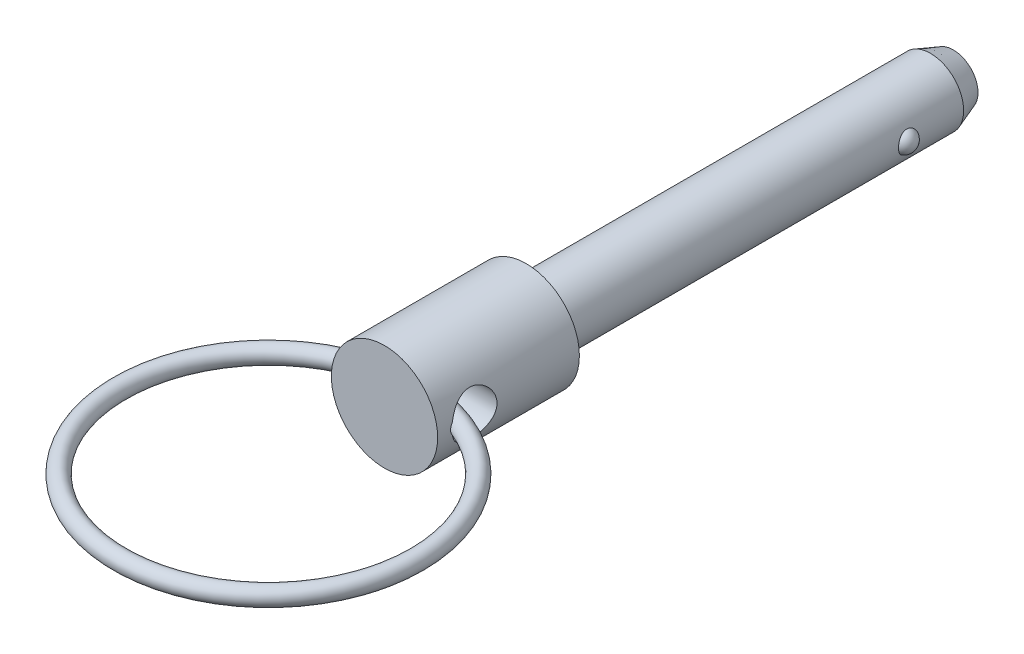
ISO-10303-21;
HEADER;
FILE_DESCRIPTION(('STEP AP214'),'2;1');
FILE_NAME('part.step','',(''),(''),'','','');
FILE_SCHEMA(('AUTOMOTIVE_DESIGN { 1 0 10303 214 1 1 1 1 }'));
ENDSEC;
DATA;
#1=APPLICATION_CONTEXT('core data for automotive mechanical design processes');
#2=APPLICATION_PROTOCOL_DEFINITION('international standard','automotive_design',2000,#1);
#3=PRODUCT_CONTEXT('',#1,'mechanical');
#4=PRODUCT('Part','Part','',(#3));
#5=PRODUCT_RELATED_PRODUCT_CATEGORY('part','',(#4));
#6=PRODUCT_DEFINITION_FORMATION('','',#4);
#7=PRODUCT_DEFINITION_CONTEXT('part definition',#1,'design');
#8=PRODUCT_DEFINITION('design','',#6,#7);
#9=PRODUCT_DEFINITION_SHAPE('','',#8);
#10=(LENGTH_UNIT() NAMED_UNIT(*) SI_UNIT(.MILLI.,.METRE.));
#11=(NAMED_UNIT(*) PLANE_ANGLE_UNIT() SI_UNIT($,.RADIAN.));
#12=(NAMED_UNIT(*) SI_UNIT($,.STERADIAN.) SOLID_ANGLE_UNIT());
#13=UNCERTAINTY_MEASURE_WITH_UNIT(LENGTH_MEASURE(1.E-05),#10,'distance_accuracy_value','');
#14=(GEOMETRIC_REPRESENTATION_CONTEXT(3) GLOBAL_UNCERTAINTY_ASSIGNED_CONTEXT((#13)) GLOBAL_UNIT_ASSIGNED_CONTEXT((#10,
#11,#12)) REPRESENTATION_CONTEXT('',''));
#15=CARTESIAN_POINT('',(0.,0.,0.));
#16=DIRECTION('',(0.,0.,1.));
#17=DIRECTION('',(1.,0.,0.));
#18=AXIS2_PLACEMENT_3D('',#15,#16,#17);
#19=CARTESIAN_POINT('',(6.35,0.,9.398));
#20=DIRECTION('',(-1.,0.,0.));
#21=DIRECTION('',(0.,0.,-1.));
#22=AXIS2_PLACEMENT_3D('',#19,#20,#21);
#23=CYLINDRICAL_SURFACE('',#22,2.0193);
#24=CARTESIAN_POINT('',(-4.76270000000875,0.498153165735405,11.3548893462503));
#25=CARTESIAN_POINT('',(-4.72833190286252,0.475048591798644,11.3607446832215));
#26=CARTESIAN_POINT('',(-4.69505034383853,0.449919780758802,11.3667299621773));
#27=CARTESIAN_POINT('',(-4.63192457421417,0.394832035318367,11.3785339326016));
#28=CARTESIAN_POINT('',(-4.60213511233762,0.364810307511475,11.3843491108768));
#29=CARTESIAN_POINT('',(-4.55535458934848,0.308281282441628,11.393775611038));
#30=CARTESIAN_POINT('',(-4.53705372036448,0.282907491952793,11.3975656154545));
#31=CARTESIAN_POINT('',(-4.50470768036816,0.229597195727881,11.4043835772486));
#32=CARTESIAN_POINT('',(-4.49064226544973,0.201673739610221,11.4074151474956));
#33=CARTESIAN_POINT('',(-4.46975490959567,0.148629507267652,11.4119668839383));
#34=CARTESIAN_POINT('',(-4.46210314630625,0.123852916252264,11.413657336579));
#35=CARTESIAN_POINT('',(-4.45097170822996,0.0733134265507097,11.4161269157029));
#36=CARTESIAN_POINT('',(-4.44749221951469,0.0475504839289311,11.4169060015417));
#37=CARTESIAN_POINT('',(-4.44500621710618,-0.00425946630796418,11.4174619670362));
#38=CARTESIAN_POINT('',(-4.44600914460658,-0.0303069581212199,11.4172367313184));
#39=CARTESIAN_POINT('',(-4.45241947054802,-0.0818207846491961,11.4158064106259));
#40=CARTESIAN_POINT('',(-4.45782777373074,-0.107286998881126,11.414601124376));
#41=CARTESIAN_POINT('',(-4.47240849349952,-0.156294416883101,11.4113883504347));
#42=CARTESIAN_POINT('',(-4.48147591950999,-0.179868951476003,11.4094032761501));
#43=CARTESIAN_POINT('',(-4.50279050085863,-0.225454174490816,11.404805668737));
#44=CARTESIAN_POINT('',(-4.51503925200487,-0.247464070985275,11.4021928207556));
#45=CARTESIAN_POINT('',(-4.55011891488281,-0.302206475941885,11.394845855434));
#46=CARTESIAN_POINT('',(-4.57493397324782,-0.333621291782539,11.3897686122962));
#47=CARTESIAN_POINT('',(-4.62912866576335,-0.392111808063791,11.3790894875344));
#48=CARTESIAN_POINT('',(-4.65852008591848,-0.419175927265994,11.3734862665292));
#49=CARTESIAN_POINT('',(-4.71307862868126,-0.4633355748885,11.3635175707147));
#50=CARTESIAN_POINT('',(-4.73757440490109,-0.481267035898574,11.3591766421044));
#51=CARTESIAN_POINT('',(-4.76270000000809,-0.498153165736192,11.3548893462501));
#52=B_SPLINE_CURVE_WITH_KNOTS('',3,(#24,#25,#26,#27,#28,#29,#30,#31,#32,#33,#34,#35,#36,#37,#38,
#39,#40,#41,#42,#43,#44,#45,#46,#47,#48,#49,#50,#51),.UNSPECIFIED.,.F.,.F.,(4,2,2,2,2,2,2,2,2,2,
2,2,2,4),(0.,0.125801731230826,0.253367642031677,0.347579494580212,0.441333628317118,
0.518959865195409,0.596589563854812,0.674382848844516,0.752192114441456,0.827911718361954,
0.903669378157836,1.02403641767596,1.14471874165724,1.23653238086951),.UNSPECIFIED.);
#53=CARTESIAN_POINT('',(-4.73813099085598,0.481166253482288,11.3591352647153));
#54=VERTEX_POINT('',#53);
#55=CARTESIAN_POINT('',(-4.73813099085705,-0.481166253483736,11.359135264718));
#56=VERTEX_POINT('',#55);
#57=EDGE_CURVE('E40',#54,#56,#52,.T.);
#58=ORIENTED_EDGE('',*,*,#57,.F.);
#59=CARTESIAN_POINT('',(-4.7625,0.,11.4173));
#60=CARTESIAN_POINT('',(-4.76249489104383,-0.108112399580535,11.4172937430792));
#61=CARTESIAN_POINT('',(-4.75878025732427,-0.216312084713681,11.408574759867));
#62=CARTESIAN_POINT('',(-4.74429807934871,-0.429541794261,11.3740482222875));
#63=CARTESIAN_POINT('',(-4.73352107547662,-0.534567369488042,11.3482177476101));
#64=CARTESIAN_POINT('',(-4.70606638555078,-0.738151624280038,11.2805979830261));
#65=CARTESIAN_POINT('',(-4.68940628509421,-0.836728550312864,11.2388562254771));
#66=CARTESIAN_POINT('',(-4.65179514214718,-1.02541561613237,11.1408163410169));
#67=CARTESIAN_POINT('',(-4.63084399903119,-1.11552555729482,11.0845178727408));
#68=CARTESIAN_POINT('',(-4.58553515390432,-1.28946876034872,10.9559107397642));
#69=CARTESIAN_POINT('',(-4.56106355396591,-1.37280723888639,10.8829734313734));
#70=CARTESIAN_POINT('',(-4.51195602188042,-1.52649281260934,10.7244940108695));
#71=CARTESIAN_POINT('',(-4.48732001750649,-1.5968337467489,10.6389459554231));
#72=CARTESIAN_POINT('',(-4.43925108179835,-1.72611165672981,10.4523438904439));
#73=CARTESIAN_POINT('',(-4.41594507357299,-1.78427664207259,10.3507188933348));
#74=CARTESIAN_POINT('',(-4.3749946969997,-1.88246618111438,10.1379969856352));
#75=CARTESIAN_POINT('',(-4.35734737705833,-1.92250019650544,10.0269050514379));
#76=CARTESIAN_POINT('',(-4.33095312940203,-1.98122376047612,9.80411364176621));
#77=CARTESIAN_POINT('',(-4.32180970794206,-2.00086973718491,9.692715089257));
#78=CARTESIAN_POINT('',(-4.31232297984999,-2.02124136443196,9.46785625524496));
#79=CARTESIAN_POINT('',(-4.31197457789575,-2.02197796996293,9.35439720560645));
#80=CARTESIAN_POINT('',(-4.31978298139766,-2.00522830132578,9.13832342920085));
#81=CARTESIAN_POINT('',(-4.32726229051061,-1.98919366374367,9.03556669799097));
#82=CARTESIAN_POINT('',(-4.34873498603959,-1.94179810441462,8.83436976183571));
#83=CARTESIAN_POINT('',(-4.36272967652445,-1.91043411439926,8.73593042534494));
#84=CARTESIAN_POINT('',(-4.39597564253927,-1.83265370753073,8.54363008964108));
#85=CARTESIAN_POINT('',(-4.41533413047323,-1.78592620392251,8.44991428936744));
#86=CARTESIAN_POINT('',(-4.45710273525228,-1.67896759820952,8.27128429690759));
#87=CARTESIAN_POINT('',(-4.47951396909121,-1.61873154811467,8.1863733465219));
#88=CARTESIAN_POINT('',(-4.52725353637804,-1.48026834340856,8.0199216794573));
#89=CARTESIAN_POINT('',(-4.55266534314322,-1.40092677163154,7.93932933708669));
#90=CARTESIAN_POINT('',(-4.6018976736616,-1.22958667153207,7.79224755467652));
#91=CARTESIAN_POINT('',(-4.62571737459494,-1.13758167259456,7.72576536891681));
#92=CARTESIAN_POINT('',(-4.66982369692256,-0.940529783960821,7.60732387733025));
#93=CARTESIAN_POINT('',(-4.69000583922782,-0.835212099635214,7.55577397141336));
#94=CARTESIAN_POINT('',(-4.72372878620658,-0.61641653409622,7.47153070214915));
#95=CARTESIAN_POINT('',(-4.73728278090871,-0.502955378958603,7.43879986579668));
#96=CARTESIAN_POINT('',(-4.75192155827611,-0.323662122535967,7.40374908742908));
#97=CARTESIAN_POINT('',(-4.75587275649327,-0.259363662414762,7.39437239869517));
#98=CARTESIAN_POINT('',(-4.76116348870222,-0.130053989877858,7.3818460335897));
#99=CARTESIAN_POINT('',(-4.76250307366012,-0.0650427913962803,7.37869623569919));
#100=CARTESIAN_POINT('',(-4.76249489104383,0.108112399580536,7.37870625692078));
#101=CARTESIAN_POINT('',(-4.75878025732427,0.21631208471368,7.38742524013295));
#102=CARTESIAN_POINT('',(-4.74429807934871,0.429541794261,7.42195177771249));
#103=CARTESIAN_POINT('',(-4.73352107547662,0.534567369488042,7.44778225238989));
#104=CARTESIAN_POINT('',(-4.70606638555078,0.738151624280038,7.51540201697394));
#105=CARTESIAN_POINT('',(-4.68940628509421,0.836728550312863,7.55714377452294));
#106=CARTESIAN_POINT('',(-4.65179514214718,1.02541561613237,7.65518365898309));
#107=CARTESIAN_POINT('',(-4.63084399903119,1.11552555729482,7.71148212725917));
#108=CARTESIAN_POINT('',(-4.58553515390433,1.28946876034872,7.84008926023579));
#109=CARTESIAN_POINT('',(-4.56106355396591,1.37280723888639,7.91302656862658));
#110=CARTESIAN_POINT('',(-4.51195602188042,1.52649281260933,8.07150598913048));
#111=CARTESIAN_POINT('',(-4.48732001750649,1.59683374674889,8.15705404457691));
#112=CARTESIAN_POINT('',(-4.43925108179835,1.7261116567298,8.34365610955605));
#113=CARTESIAN_POINT('',(-4.415945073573,1.78427664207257,8.44528110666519));
#114=CARTESIAN_POINT('',(-4.3749946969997,1.88246618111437,8.65800301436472));
#115=CARTESIAN_POINT('',(-4.35734737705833,1.92250019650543,8.76909494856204));
#116=CARTESIAN_POINT('',(-4.33095312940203,1.98122376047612,8.99188635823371));
#117=CARTESIAN_POINT('',(-4.32180970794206,2.0008697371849,9.10328491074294));
#118=CARTESIAN_POINT('',(-4.31232297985,2.02124136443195,9.32814374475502));
#119=CARTESIAN_POINT('',(-4.31197457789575,2.02197796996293,9.44160279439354));
#120=CARTESIAN_POINT('',(-4.31978298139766,2.00522830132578,9.65767657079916));
#121=CARTESIAN_POINT('',(-4.32726229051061,1.98919366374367,9.76043330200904));
#122=CARTESIAN_POINT('',(-4.34873498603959,1.94179810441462,9.96163023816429));
#123=CARTESIAN_POINT('',(-4.36272967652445,1.91043411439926,10.0600695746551));
#124=CARTESIAN_POINT('',(-4.39597564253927,1.83265370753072,10.2523699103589));
#125=CARTESIAN_POINT('',(-4.41533413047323,1.78592620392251,10.3460857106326));
#126=CARTESIAN_POINT('',(-4.45710273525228,1.67896759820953,10.5247157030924));
#127=CARTESIAN_POINT('',(-4.47951396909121,1.61873154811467,10.6096266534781));
#128=CARTESIAN_POINT('',(-4.52725353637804,1.48026834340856,10.7760783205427));
#129=CARTESIAN_POINT('',(-4.55266534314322,1.40092677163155,10.8566706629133));
#130=CARTESIAN_POINT('',(-4.6018976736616,1.22958667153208,11.0037524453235));
#131=CARTESIAN_POINT('',(-4.62571737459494,1.13758167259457,11.0702346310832));
#132=CARTESIAN_POINT('',(-4.66982369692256,0.940529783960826,11.1886761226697));
#133=CARTESIAN_POINT('',(-4.69000583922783,0.835212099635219,11.2402260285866));
#134=CARTESIAN_POINT('',(-4.72372878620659,0.616416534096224,11.3244692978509));
#135=CARTESIAN_POINT('',(-4.73728278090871,0.502955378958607,11.3572001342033));
#136=CARTESIAN_POINT('',(-4.75192155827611,0.323662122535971,11.3922509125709));
#137=CARTESIAN_POINT('',(-4.75587275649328,0.259363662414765,11.4016276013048));
#138=CARTESIAN_POINT('',(-4.76116348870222,0.13005398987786,11.4141539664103));
#139=CARTESIAN_POINT('',(-4.76250307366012,0.065042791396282,11.4173037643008));
#140=CARTESIAN_POINT('',(-4.7625,0.,11.4173));
#141=B_SPLINE_CURVE_WITH_KNOTS('',3,(#59,#60,#61,#62,#63,#64,#65,#66,#67,#68,#69,#70,#71,#72,
#73,#74,#75,#76,#77,#78,#79,#80,#81,#82,#83,#84,#85,#86,#87,#88,#89,#90,#91,#92,#93,#94,#95,#96,
#97,#98,#99,#100,#101,#102,#103,#104,#105,#106,#107,#108,#109,#110,#111,#112,#113,#114,#115,
#116,#117,#118,#119,#120,#121,#122,#123,#124,#125,#126,#127,#128,#129,#130,#131,#132,#133,#134,
#135,#136,#137,#138,#139,#140),.UNSPECIFIED.,.T.,.F.,(4,2,2,2,2,2,2,2,2,2,2,2,2,2,2,2,2,2,2,2,2,
2,2,2,2,2,2,2,2,2,2,2,2,2,2,2,2,2,2,2,4),(0.,0.324084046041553,0.648603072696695,
0.972160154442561,1.29572482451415,1.63451297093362,1.97346129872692,2.32983137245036,
2.6860152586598,3.02460962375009,3.36300782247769,3.67436181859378,3.98577815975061,
4.30393445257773,4.6222074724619,4.96838833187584,5.31474674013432,5.66985671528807,
6.02425711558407,6.21923699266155,6.41421306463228,6.73829711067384,7.06281613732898,
7.38637321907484,7.70993788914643,8.0487260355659,8.3876743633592,8.74404443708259,
9.100228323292,9.43882268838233,9.77722088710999,10.0885748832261,10.3999912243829,
10.71814751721,11.0364205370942,11.3826013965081,11.7289598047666,12.0840697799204,
12.4384701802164,12.6334500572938,12.8284261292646),.UNSPECIFIED.);
#142=EDGE_CURVE('E54',#56,#54,#141,.T.);
#143=ORIENTED_EDGE('',*,*,#142,.F.);
#144=EDGE_LOOP('',(#58,#143));
#145=FACE_BOUND('',#144,.T.);
#146=CARTESIAN_POINT('',(4.76270000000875,-0.498153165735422,11.3548893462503));
#147=CARTESIAN_POINT('',(4.72833190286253,-0.47504859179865,11.3607446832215));
#148=CARTESIAN_POINT('',(4.69505034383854,-0.44991978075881,11.3667299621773));
#149=CARTESIAN_POINT('',(4.63192457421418,-0.394832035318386,11.3785339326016));
#150=CARTESIAN_POINT('',(4.60213511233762,-0.364810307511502,11.3843491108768));
#151=CARTESIAN_POINT('',(4.55535458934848,-0.308281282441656,11.393775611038));
#152=CARTESIAN_POINT('',(4.53705372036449,-0.282907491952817,11.3975656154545));
#153=CARTESIAN_POINT('',(4.50470768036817,-0.229597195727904,11.4043835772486));
#154=CARTESIAN_POINT('',(4.49064226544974,-0.201673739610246,11.4074151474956));
#155=CARTESIAN_POINT('',(4.46975490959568,-0.14862950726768,11.4119668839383));
#156=CARTESIAN_POINT('',(4.46210314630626,-0.123852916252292,11.413657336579));
#157=CARTESIAN_POINT('',(4.45097170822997,-0.0733134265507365,11.4161269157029));
#158=CARTESIAN_POINT('',(4.44749221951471,-0.0475504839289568,11.4169060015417));
#159=CARTESIAN_POINT('',(4.4450062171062,0.00425946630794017,11.4174619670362));
#160=CARTESIAN_POINT('',(4.44600914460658,0.0303069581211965,11.4172367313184));
#161=CARTESIAN_POINT('',(4.45241947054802,0.0818207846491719,11.4158064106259));
#162=CARTESIAN_POINT('',(4.45782777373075,0.107286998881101,11.414601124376));
#163=CARTESIAN_POINT('',(4.47240849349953,0.156294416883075,11.4113883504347));
#164=CARTESIAN_POINT('',(4.48147591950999,0.179868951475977,11.4094032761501));
#165=CARTESIAN_POINT('',(4.50279050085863,0.225454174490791,11.404805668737));
#166=CARTESIAN_POINT('',(4.51503925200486,0.247464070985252,11.4021928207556));
#167=CARTESIAN_POINT('',(4.5501189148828,0.30220647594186,11.394845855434));
#168=CARTESIAN_POINT('',(4.57493397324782,0.333621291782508,11.3897686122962));
#169=CARTESIAN_POINT('',(4.62912866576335,0.392111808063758,11.3790894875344));
#170=CARTESIAN_POINT('',(4.65852008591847,0.419175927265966,11.3734862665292));
#171=CARTESIAN_POINT('',(4.71307862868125,0.463335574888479,11.3635175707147));
#172=CARTESIAN_POINT('',(4.73757440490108,0.481267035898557,11.3591766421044));
#173=CARTESIAN_POINT('',(4.76270000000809,0.498153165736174,11.3548893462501));
#174=B_SPLINE_CURVE_WITH_KNOTS('',3,(#146,#147,#148,#149,#150,#151,#152,#153,#154,#155,#156,
#157,#158,#159,#160,#161,#162,#163,#164,#165,#166,#167,#168,#169,#170,#171,#172,#173),
.UNSPECIFIED.,.F.,.F.,(4,2,2,2,2,2,2,2,2,2,2,2,2,4),(0.,0.125801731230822,0.253367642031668,
0.3475794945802,0.441333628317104,0.518959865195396,0.596589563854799,0.674382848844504,
0.752192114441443,0.827911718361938,0.903669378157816,1.02403641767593,1.14471874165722,
1.2365323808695),.UNSPECIFIED.);
#175=CARTESIAN_POINT('',(4.73813099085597,-0.4811662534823,11.3591352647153));
#176=VERTEX_POINT('',#175);
#177=CARTESIAN_POINT('',(4.73813099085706,0.481166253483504,11.359135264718));
#178=VERTEX_POINT('',#177);
#179=EDGE_CURVE('E33',#176,#178,#174,.T.);
#180=ORIENTED_EDGE('',*,*,#179,.F.);
#181=CARTESIAN_POINT('',(4.7625,0.,7.3787));
#182=CARTESIAN_POINT('',(4.76249489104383,-0.108112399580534,7.37870625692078));
#183=CARTESIAN_POINT('',(4.75878025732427,-0.216312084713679,7.38742524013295));
#184=CARTESIAN_POINT('',(4.74429807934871,-0.429541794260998,7.42195177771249));
#185=CARTESIAN_POINT('',(4.73352107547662,-0.53456736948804,7.44778225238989));
#186=CARTESIAN_POINT('',(4.70606638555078,-0.738151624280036,7.51540201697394));
#187=CARTESIAN_POINT('',(4.68940628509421,-0.836728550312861,7.55714377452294));
#188=CARTESIAN_POINT('',(4.65179514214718,-1.02541561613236,7.65518365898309));
#189=CARTESIAN_POINT('',(4.63084399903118,-1.11552555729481,7.71148212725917));
#190=CARTESIAN_POINT('',(4.58553515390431,-1.28946876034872,7.8400892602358));
#191=CARTESIAN_POINT('',(4.5610635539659,-1.37280723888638,7.91302656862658));
#192=CARTESIAN_POINT('',(4.51195602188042,-1.52649281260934,8.07150598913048));
#193=CARTESIAN_POINT('',(4.48732001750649,-1.5968337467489,8.15705404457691));
#194=CARTESIAN_POINT('',(4.43925108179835,-1.7261116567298,8.34365610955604));
#195=CARTESIAN_POINT('',(4.41594507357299,-1.78427664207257,8.44528110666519));
#196=CARTESIAN_POINT('',(4.3749946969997,-1.88246618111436,8.65800301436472));
#197=CARTESIAN_POINT('',(4.35734737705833,-1.92250019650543,8.76909494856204));
#198=CARTESIAN_POINT('',(4.33095312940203,-1.98122376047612,8.99188635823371));
#199=CARTESIAN_POINT('',(4.32180970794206,-2.0008697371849,9.10328491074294));
#200=CARTESIAN_POINT('',(4.31232297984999,-2.02124136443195,9.32814374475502));
#201=CARTESIAN_POINT('',(4.31197457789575,-2.02197796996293,9.44160279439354));
#202=CARTESIAN_POINT('',(4.31978298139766,-2.00522830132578,9.65767657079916));
#203=CARTESIAN_POINT('',(4.32726229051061,-1.98919366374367,9.76043330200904));
#204=CARTESIAN_POINT('',(4.34873498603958,-1.94179810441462,9.96163023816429));
#205=CARTESIAN_POINT('',(4.36272967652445,-1.91043411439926,10.0600695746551));
#206=CARTESIAN_POINT('',(4.39597564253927,-1.83265370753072,10.2523699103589));
#207=CARTESIAN_POINT('',(4.41533413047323,-1.78592620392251,10.3460857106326));
#208=CARTESIAN_POINT('',(4.45710273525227,-1.67896759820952,10.5247157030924));
#209=CARTESIAN_POINT('',(4.47951396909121,-1.61873154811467,10.6096266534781));
#210=CARTESIAN_POINT('',(4.52725353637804,-1.48026834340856,10.7760783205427));
#211=CARTESIAN_POINT('',(4.55266534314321,-1.40092677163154,10.8566706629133));
#212=CARTESIAN_POINT('',(4.60189767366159,-1.22958667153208,11.0037524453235));
#213=CARTESIAN_POINT('',(4.62571737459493,-1.13758167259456,11.0702346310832));
#214=CARTESIAN_POINT('',(4.66982369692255,-0.94052978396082,11.1886761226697));
#215=CARTESIAN_POINT('',(4.69000583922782,-0.835212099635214,11.2402260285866));
#216=CARTESIAN_POINT('',(4.72372878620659,-0.616416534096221,11.3244692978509));
#217=CARTESIAN_POINT('',(4.73728278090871,-0.502955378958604,11.3572001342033));
#218=CARTESIAN_POINT('',(4.75192155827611,-0.323662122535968,11.3922509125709));
#219=CARTESIAN_POINT('',(4.75587275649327,-0.259363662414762,11.4016276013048));
#220=CARTESIAN_POINT('',(4.76116348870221,-0.130053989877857,11.4141539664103));
#221=CARTESIAN_POINT('',(4.76250307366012,-0.0650427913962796,11.4173037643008));
#222=CARTESIAN_POINT('',(4.76249489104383,0.108112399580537,11.4172937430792));
#223=CARTESIAN_POINT('',(4.75878025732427,0.216312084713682,11.408574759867));
#224=CARTESIAN_POINT('',(4.74429807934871,0.429541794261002,11.3740482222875));
#225=CARTESIAN_POINT('',(4.73352107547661,0.534567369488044,11.3482177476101));
#226=CARTESIAN_POINT('',(4.70606638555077,0.73815162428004,11.2805979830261));
#227=CARTESIAN_POINT('',(4.68940628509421,0.836728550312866,11.2388562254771));
#228=CARTESIAN_POINT('',(4.65179514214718,1.02541561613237,11.1408163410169));
#229=CARTESIAN_POINT('',(4.63084399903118,1.11552555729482,11.0845178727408));
#230=CARTESIAN_POINT('',(4.58553515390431,1.28946876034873,10.9559107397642));
#231=CARTESIAN_POINT('',(4.5610635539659,1.37280723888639,10.8829734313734));
#232=CARTESIAN_POINT('',(4.51195602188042,1.52649281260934,10.7244940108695));
#233=CARTESIAN_POINT('',(4.48732001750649,1.5968337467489,10.6389459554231));
#234=CARTESIAN_POINT('',(4.43925108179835,1.72611165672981,10.4523438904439));
#235=CARTESIAN_POINT('',(4.41594507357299,1.78427664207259,10.3507188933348));
#236=CARTESIAN_POINT('',(4.37499469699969,1.88246618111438,10.1379969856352));
#237=CARTESIAN_POINT('',(4.35734737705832,1.92250019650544,10.0269050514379));
#238=CARTESIAN_POINT('',(4.33095312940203,1.98122376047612,9.80411364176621));
#239=CARTESIAN_POINT('',(4.32180970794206,2.00086973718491,9.692715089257));
#240=CARTESIAN_POINT('',(4.31232297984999,2.02124136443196,9.46785625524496));
#241=CARTESIAN_POINT('',(4.31197457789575,2.02197796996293,9.35439720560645));
#242=CARTESIAN_POINT('',(4.31978298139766,2.00522830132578,9.13832342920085));
#243=CARTESIAN_POINT('',(4.32726229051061,1.98919366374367,9.03556669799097));
#244=CARTESIAN_POINT('',(4.34873498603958,1.94179810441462,8.83436976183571));
#245=CARTESIAN_POINT('',(4.36272967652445,1.91043411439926,8.73593042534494));
#246=CARTESIAN_POINT('',(4.39597564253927,1.83265370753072,8.54363008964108));
#247=CARTESIAN_POINT('',(4.41533413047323,1.78592620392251,8.44991428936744));
#248=CARTESIAN_POINT('',(4.45710273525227,1.67896759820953,8.27128429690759));
#249=CARTESIAN_POINT('',(4.47951396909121,1.61873154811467,8.1863733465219));
#250=CARTESIAN_POINT('',(4.52725353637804,1.48026834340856,8.0199216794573));
#251=CARTESIAN_POINT('',(4.55266534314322,1.40092677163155,7.93932933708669));
#252=CARTESIAN_POINT('',(4.60189767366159,1.22958667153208,7.79224755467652));
#253=CARTESIAN_POINT('',(4.62571737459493,1.13758167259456,7.72576536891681));
#254=CARTESIAN_POINT('',(4.66982369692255,0.940529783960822,7.60732387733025));
#255=CARTESIAN_POINT('',(4.69000583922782,0.835212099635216,7.55577397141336));
#256=CARTESIAN_POINT('',(4.72372878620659,0.616416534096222,7.47153070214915));
#257=CARTESIAN_POINT('',(4.73728278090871,0.502955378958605,7.43879986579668));
#258=CARTESIAN_POINT('',(4.75192155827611,0.323662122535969,7.40374908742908));
#259=CARTESIAN_POINT('',(4.75587275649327,0.259363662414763,7.39437239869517));
#260=CARTESIAN_POINT('',(4.76116348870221,0.130053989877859,7.3818460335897));
#261=CARTESIAN_POINT('',(4.76250307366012,0.0650427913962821,7.37869623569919));
#262=CARTESIAN_POINT('',(4.7625,0.,7.3787));
#263=B_SPLINE_CURVE_WITH_KNOTS('',3,(#181,#182,#183,#184,#185,#186,#187,#188,#189,#190,#191,
#192,#193,#194,#195,#196,#197,#198,#199,#200,#201,#202,#203,#204,#205,#206,#207,#208,#209,#210,
#211,#212,#213,#214,#215,#216,#217,#218,#219,#220,#221,#222,#223,#224,#225,#226,#227,#228,#229,
#230,#231,#232,#233,#234,#235,#236,#237,#238,#239,#240,#241,#242,#243,#244,#245,#246,#247,#248,
#249,#250,#251,#252,#253,#254,#255,#256,#257,#258,#259,#260,#261,#262),.UNSPECIFIED.,.T.,.F.,(4,
2,2,2,2,2,2,2,2,2,2,2,2,2,2,2,2,2,2,2,2,2,2,2,2,2,2,2,2,2,2,2,2,2,2,2,2,2,2,2,4),(0.,
0.324084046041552,0.648603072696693,0.972160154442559,1.29572482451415,1.63451297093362,
1.97346129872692,2.32983137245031,2.68601525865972,3.02460962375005,3.36300782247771,
3.67436181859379,3.98577815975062,4.30393445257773,4.62220747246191,4.96838833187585,
5.31474674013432,5.66985671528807,6.02425711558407,6.21923699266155,6.41421306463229,
6.73829711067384,7.06281613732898,7.38637321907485,7.70993788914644,8.04872603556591,
8.38767436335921,8.74404443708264,9.10022832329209,9.43882268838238,9.77722088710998,
10.0885748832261,10.3999912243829,10.71814751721,11.0364205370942,11.3826013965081,
11.7289598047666,12.0840697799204,12.4384701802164,12.6334500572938,12.8284261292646),.UNSPECIFIED.);
#264=EDGE_CURVE('E50',#178,#176,#263,.T.);
#265=ORIENTED_EDGE('',*,*,#264,.F.);
#266=EDGE_LOOP('',(#180,#265));
#267=FACE_BOUND('',#266,.T.);
#268=ADVANCED_FACE('F14',(#145,#267),#23,.F.);
#269=CARTESIAN_POINT('',(0.,0.,-23.2664));
#270=DIRECTION('',(0.,0.,-1.));
#271=DIRECTION('',(1.,0.,0.));
#272=AXIS2_PLACEMENT_3D('',#269,#270,#271);
#273=CYLINDRICAL_SURFACE('',#272,4.7625);
#274=ORIENTED_EDGE('',*,*,#264,.T.);
#275=CARTESIAN_POINT('',(4.75672783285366,-0.234410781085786,9.8638909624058));
#276=CARTESIAN_POINT('',(4.75463715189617,-0.276823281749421,9.87695364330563));
#277=CARTESIAN_POINT('',(4.75202741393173,-0.318142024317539,9.89358560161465));
#278=CARTESIAN_POINT('',(4.74605906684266,-0.397384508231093,9.93354154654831));
#279=CARTESIAN_POINT('',(4.74269965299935,-0.43530453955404,9.95687273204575));
#280=CARTESIAN_POINT('',(4.7356117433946,-0.506628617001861,10.0095466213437));
#281=CARTESIAN_POINT('',(4.731883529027,-0.540036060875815,10.0388847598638));
#282=CARTESIAN_POINT('',(4.72446904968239,-0.601463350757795,10.1027270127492));
#283=CARTESIAN_POINT('',(4.72078277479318,-0.629484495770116,10.1372298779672));
#284=CARTESIAN_POINT('',(4.71381973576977,-0.679675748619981,10.2106969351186));
#285=CARTESIAN_POINT('',(4.71054647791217,-0.701797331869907,10.2496945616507));
#286=CARTESIAN_POINT('',(4.70478201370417,-0.739457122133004,10.3307970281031));
#287=CARTESIAN_POINT('',(4.7022909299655,-0.754994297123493,10.3729023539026));
#288=CARTESIAN_POINT('',(4.69825743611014,-0.779709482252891,10.4605198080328));
#289=CARTESIAN_POINT('',(4.69674995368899,-0.788654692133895,10.5060989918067));
#290=CARTESIAN_POINT('',(4.69494168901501,-0.799348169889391,10.5981124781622));
#291=CARTESIAN_POINT('',(4.69464124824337,-0.801094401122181,10.6445470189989));
#292=CARTESIAN_POINT('',(4.69525593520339,-0.797484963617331,10.7400273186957));
#293=CARTESIAN_POINT('',(4.6962479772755,-0.791679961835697,10.7890554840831));
#294=CARTESIAN_POINT('',(4.69943436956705,-0.772538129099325,10.88558205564));
#295=CARTESIAN_POINT('',(4.70162918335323,-0.759198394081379,10.9330798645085));
#296=CARTESIAN_POINT('',(4.7071366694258,-0.724294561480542,11.0283694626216));
#297=CARTESIAN_POINT('',(4.71051187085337,-0.702258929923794,11.0759856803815));
#298=CARTESIAN_POINT('',(4.71792781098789,-0.650571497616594,11.1668661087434));
#299=CARTESIAN_POINT('',(4.72196879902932,-0.620916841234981,11.2101286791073));
#300=CARTESIAN_POINT('',(4.73024120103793,-0.554392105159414,11.2909794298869));
#301=CARTESIAN_POINT('',(4.73447324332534,-0.517496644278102,11.3285468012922));
#302=CARTESIAN_POINT('',(4.74255290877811,-0.437280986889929,11.3961281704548));
#303=CARTESIAN_POINT('',(4.74640083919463,-0.393965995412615,11.4261482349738));
#304=CARTESIAN_POINT('',(4.75279848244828,-0.306647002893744,11.4743172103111));
#305=CARTESIAN_POINT('',(4.7554392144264,-0.263139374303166,11.4933494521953));
#306=CARTESIAN_POINT('',(4.75956072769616,-0.173210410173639,11.5225838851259));
#307=CARTESIAN_POINT('',(4.76104300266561,-0.126792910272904,11.5327974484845));
#308=CARTESIAN_POINT('',(4.7625121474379,-0.0392228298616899,11.5429046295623));
#309=CARTESIAN_POINT('',(4.76267454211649,0.00179015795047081,11.5440098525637));
#310=CARTESIAN_POINT('',(4.76194485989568,0.083358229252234,11.5390051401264));
#311=CARTESIAN_POINT('',(4.76105302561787,0.123913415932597,11.5328968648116));
#312=CARTESIAN_POINT('',(4.75839052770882,0.201390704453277,11.5143023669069));
#313=CARTESIAN_POINT('',(4.7566647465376,0.238393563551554,11.5021410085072));
#314=CARTESIAN_POINT('',(4.75253498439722,0.310009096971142,11.4722173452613));
#315=CARTESIAN_POINT('',(4.75013086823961,0.344621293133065,11.4544539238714));
#316=CARTESIAN_POINT('',(4.74468244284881,0.413106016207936,11.4126354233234));
#317=CARTESIAN_POINT('',(4.74160529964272,0.446760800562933,11.3882294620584));
#318=CARTESIAN_POINT('',(4.73521429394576,0.510064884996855,11.3347169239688));
#319=CARTESIAN_POINT('',(4.73190032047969,0.539712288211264,11.3056081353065));
#320=CARTESIAN_POINT('',(4.72489226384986,0.598141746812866,11.2395451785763));
#321=CARTESIAN_POINT('',(4.72120374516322,0.626328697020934,11.2020637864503));
#322=CARTESIAN_POINT('',(4.71424234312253,0.67673773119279,11.1232450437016));
#323=CARTESIAN_POINT('',(4.71096968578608,0.698956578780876,11.0819056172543));
#324=CARTESIAN_POINT('',(4.70485086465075,0.739081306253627,10.9918449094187));
#325=CARTESIAN_POINT('',(4.70208579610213,0.75628748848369,10.9428045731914));
#326=CARTESIAN_POINT('',(4.69779376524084,0.782507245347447,10.8425158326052));
#327=CARTESIAN_POINT('',(4.69626707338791,0.79151903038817,10.7912669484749));
#328=CARTESIAN_POINT('',(4.69466144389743,0.80099052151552,10.6869325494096));
#329=CARTESIAN_POINT('',(4.69461132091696,0.801280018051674,10.6338307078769));
#330=CARTESIAN_POINT('',(4.69610058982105,0.792506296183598,10.5284214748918));
#331=CARTESIAN_POINT('',(4.69763938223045,0.783446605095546,10.4761137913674));
#332=CARTESIAN_POINT('',(4.70202301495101,0.756674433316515,10.3770218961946));
#333=CARTESIAN_POINT('',(4.70478816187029,0.739486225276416,10.3300928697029));
#334=CARTESIAN_POINT('',(4.71127399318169,0.696967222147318,10.2401511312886));
#335=CARTESIAN_POINT('',(4.71499427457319,0.671639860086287,10.1971367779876));
#336=CARTESIAN_POINT('',(4.72264431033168,0.615452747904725,10.1192841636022));
#337=CARTESIAN_POINT('',(4.72654308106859,0.585080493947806,10.0840903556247));
#338=CARTESIAN_POINT('',(4.73429341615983,0.518639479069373,10.0195645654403));
#339=CARTESIAN_POINT('',(4.73814499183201,0.482572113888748,9.9902311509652));
#340=CARTESIAN_POINT('',(4.74520575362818,0.407195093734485,9.93927752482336));
#341=CARTESIAN_POINT('',(4.74843306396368,0.368048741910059,9.91741780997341));
#342=CARTESIAN_POINT('',(4.75404590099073,0.28656451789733,9.88060848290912));
#343=CARTESIAN_POINT('',(4.75643129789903,0.244226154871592,9.86565993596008));
#344=CARTESIAN_POINT('',(4.76007108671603,0.15802691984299,9.84320151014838));
#345=CARTESIAN_POINT('',(4.76133640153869,0.114185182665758,9.83561971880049));
#346=CARTESIAN_POINT('',(4.76263391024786,0.0258666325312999,9.82784590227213));
#347=CARTESIAN_POINT('',(4.76266746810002,-0.0186094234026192,9.82764570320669));
#348=CARTESIAN_POINT('',(4.76170334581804,-0.0918724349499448,9.83342133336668));
#349=CARTESIAN_POINT('',(4.76105293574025,-0.12084461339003,9.83731729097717));
#350=CARTESIAN_POINT('',(4.75925240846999,-0.178172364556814,9.84825826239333));
#351=CARTESIAN_POINT('',(4.7581022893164,-0.206527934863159,9.85530328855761));
#352=CARTESIAN_POINT('',(4.75672783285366,-0.234410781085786,9.8638909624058));
#353=B_SPLINE_CURVE_WITH_KNOTS('',3,(#275,#276,#277,#278,#279,#280,#281,#282,#283,#284,#285,
#286,#287,#288,#289,#290,#291,#292,#293,#294,#295,#296,#297,#298,#299,#300,#301,#302,#303,#304,
#305,#306,#307,#308,#309,#310,#311,#312,#313,#314,#315,#316,#317,#318,#319,#320,#321,#322,#323,
#324,#325,#326,#327,#328,#329,#330,#331,#332,#333,#334,#335,#336,#337,#338,#339,#340,#341,#342,
#343,#344,#345,#346,#347,#348,#349,#350,#351,#352),.UNSPECIFIED.,.T.,.F.,(4,2,2,2,2,2,2,2,2,2,2,
2,2,2,2,2,2,2,2,2,2,2,2,2,2,2,2,2,2,2,2,2,2,2,2,2,2,2,4),(0.,0.133176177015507,
0.266496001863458,0.399714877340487,0.532901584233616,0.667152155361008,0.801423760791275,
0.940235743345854,1.07908699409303,1.22659070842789,1.37415131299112,1.53115159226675,
1.68821080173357,1.84583071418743,2.00332351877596,2.14516294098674,2.28681917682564,
2.40926643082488,2.53168551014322,2.64814679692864,2.76463131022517,2.88919364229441,
3.01381473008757,3.15436663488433,3.29499460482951,3.45041783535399,3.60587500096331,
3.76436388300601,3.92279299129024,4.07216500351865,4.22147409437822,4.36072714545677,
4.49994612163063,4.63415709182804,4.7683887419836,4.90129648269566,5.03405704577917,
5.12160944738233,5.20916219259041),.UNSPECIFIED.);
#354=EDGE_CURVE('E27',#176,#178,#353,.T.);
#355=ORIENTED_EDGE('',*,*,#354,.T.);
#356=EDGE_LOOP('',(#274,#355));
#357=FACE_BOUND('',#356,.T.);
#358=CARTESIAN_POINT('',(0.,0.,1.13520304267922E-11));
#359=DIRECTION('',(0.,0.,-1.));
#360=DIRECTION('',(1.,0.,0.));
#361=AXIS2_PLACEMENT_3D('',#358,#359,#360);
#362=CIRCLE('',#361,4.76249999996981);
#363=CARTESIAN_POINT('',(4.76249999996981,0.,1.1351820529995E-11));
#364=VERTEX_POINT('',#363);
#365=EDGE_CURVE('E59',#364,#364,#362,.T.);
#366=ORIENTED_EDGE('',*,*,#365,.F.);
#367=EDGE_LOOP('',(#366));
#368=FACE_BOUND('',#367,.T.);
#369=CARTESIAN_POINT('',(0.,0.,12.7000000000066));
#370=DIRECTION('',(0.,0.,-1.));
#371=DIRECTION('',(1.,0.,0.));
#372=AXIS2_PLACEMENT_3D('',#369,#370,#371);
#373=CIRCLE('',#372,4.76249999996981);
#374=CARTESIAN_POINT('',(4.76249999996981,0.,12.7000000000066));
#375=VERTEX_POINT('',#374);
#376=EDGE_CURVE('E135',#375,#375,#373,.T.);
#377=ORIENTED_EDGE('',*,*,#376,.T.);
#378=EDGE_LOOP('',(#377));
#379=FACE_BOUND('',#378,.T.);
#380=ORIENTED_EDGE('',*,*,#142,.T.);
#381=CARTESIAN_POINT('',(-4.75672783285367,-0.234410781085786,9.8638909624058));
#382=CARTESIAN_POINT('',(-4.75880797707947,-0.192184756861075,9.85088943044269));
#383=CARTESIAN_POINT('',(-4.76037619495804,-0.148820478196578,9.84140883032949));
#384=CARTESIAN_POINT('',(-4.76231114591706,-0.0610623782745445,9.82976057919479));
#385=CARTESIAN_POINT('',(-4.76267662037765,-0.0166675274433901,9.82760058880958));
#386=CARTESIAN_POINT('',(-4.76216356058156,0.0718447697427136,9.83066350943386));
#387=CARTESIAN_POINT('',(-4.76128553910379,0.115962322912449,9.83588337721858));
#388=CARTESIAN_POINT('',(-4.75838343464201,0.202671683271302,9.85356395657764));
#389=CARTESIAN_POINT('',(-4.75635960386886,0.245263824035,9.8660230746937));
#390=CARTESIAN_POINT('',(-4.75138989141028,0.327732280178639,9.89785096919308));
#391=CARTESIAN_POINT('',(-4.74844388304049,0.367608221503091,9.91722069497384));
#392=CARTESIAN_POINT('',(-4.74195662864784,0.443516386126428,9.96233891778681));
#393=CARTESIAN_POINT('',(-4.73841538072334,0.479548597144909,9.98808743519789));
#394=CARTESIAN_POINT('',(-4.73111995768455,0.546865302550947,10.0453065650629));
#395=CARTESIAN_POINT('',(-4.72736528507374,0.578138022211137,10.0767909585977));
#396=CARTESIAN_POINT('',(-4.72006096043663,0.635024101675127,10.1445276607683));
#397=CARTESIAN_POINT('',(-4.71651131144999,0.660637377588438,10.1807800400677));
#398=CARTESIAN_POINT('',(-4.70994476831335,0.705946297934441,10.2575433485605));
#399=CARTESIAN_POINT('',(-4.70693606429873,0.725553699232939,10.2981069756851));
#400=CARTESIAN_POINT('',(-4.70181675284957,0.758021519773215,10.3818966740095));
#401=CARTESIAN_POINT('',(-4.69970628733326,0.770880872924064,10.4251231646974));
#402=CARTESIAN_POINT('',(-4.69650867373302,0.790134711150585,10.5148288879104));
#403=CARTESIAN_POINT('',(-4.69546563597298,0.796251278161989,10.5613691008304));
#404=CARTESIAN_POINT('',(-4.69462220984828,0.801207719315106,10.6548424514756));
#405=CARTESIAN_POINT('',(-4.69482220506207,0.800045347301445,10.7017757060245));
#406=CARTESIAN_POINT('',(-4.69645733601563,0.790392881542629,10.7979976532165));
#407=CARTESIAN_POINT('',(-4.69797327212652,0.781423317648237,10.8472368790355));
#408=CARTESIAN_POINT('',(-4.70214662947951,0.755902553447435,10.943667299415));
#409=CARTESIAN_POINT('',(-4.70480451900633,0.739348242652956,10.9908576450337));
#410=CARTESIAN_POINT('',(-4.71113533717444,0.697907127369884,11.0846488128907));
#411=CARTESIAN_POINT('',(-4.71485784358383,0.672595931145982,11.1310597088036));
#412=CARTESIAN_POINT('',(-4.72278864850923,0.61443697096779,11.2188860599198));
#413=CARTESIAN_POINT('',(-4.72699707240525,0.581587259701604,11.2603002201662));
#414=CARTESIAN_POINT('',(-4.73530162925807,0.509526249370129,11.3359421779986));
#415=CARTESIAN_POINT('',(-4.73939847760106,0.470426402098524,11.3702753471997));
#416=CARTESIAN_POINT('',(-4.74699023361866,0.386343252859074,11.4308675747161));
#417=CARTESIAN_POINT('',(-4.75048579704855,0.341366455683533,11.4571354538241));
#418=CARTESIAN_POINT('',(-4.7559922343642,0.252376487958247,11.4974010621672));
#419=CARTESIAN_POINT('',(-4.75812829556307,0.208856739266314,11.5124686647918));
#420=CARTESIAN_POINT('',(-4.76120337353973,0.119700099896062,11.5339491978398));
#421=CARTESIAN_POINT('',(-4.76214369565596,0.0740655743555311,11.540371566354));
#422=CARTESIAN_POINT('',(-4.76265411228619,-0.011745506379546,11.54386707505));
#423=CARTESIAN_POINT('',(-4.76238280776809,-0.0518805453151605,11.5420222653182));
#424=CARTESIAN_POINT('',(-4.76085712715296,-0.131220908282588,11.531508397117));
#425=CARTESIAN_POINT('',(-4.75960284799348,-0.170426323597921,11.5228400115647));
#426=CARTESIAN_POINT('',(-4.75629335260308,-0.245921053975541,11.499439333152));
#427=CARTESIAN_POINT('',(-4.75425749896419,-0.282257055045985,11.4848531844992));
#428=CARTESIAN_POINT('',(-4.74958711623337,-0.352221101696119,11.4503009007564));
#429=CARTESIAN_POINT('',(-4.74695243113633,-0.3858484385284,11.4303333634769));
#430=CARTESIAN_POINT('',(-4.74107206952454,-0.452616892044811,11.3838151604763));
#431=CARTESIAN_POINT('',(-4.73779315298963,-0.485460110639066,11.3568423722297));
#432=CARTESIAN_POINT('',(-4.73110830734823,-0.546785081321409,11.2983457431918));
#433=CARTESIAN_POINT('',(-4.72770231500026,-0.575264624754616,11.2668196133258));
#434=CARTESIAN_POINT('',(-4.72061927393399,-0.630909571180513,11.1957249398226));
#435=CARTESIAN_POINT('',(-4.71696449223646,-0.657423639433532,11.1556436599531));
#436=CARTESIAN_POINT('',(-4.7102323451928,-0.704040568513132,11.071860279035));
#437=CARTESIAN_POINT('',(-4.70715528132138,-0.724140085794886,11.0281563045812));
#438=CARTESIAN_POINT('',(-4.70165375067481,-0.759079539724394,10.9340419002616));
#439=CARTESIAN_POINT('',(-4.69931471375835,-0.773270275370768,10.8833836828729));
#440=CARTESIAN_POINT('',(-4.69601325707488,-0.793074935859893,10.7803615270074));
#441=CARTESIAN_POINT('',(-4.69505096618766,-0.798688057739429,10.7279974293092));
#442=CARTESIAN_POINT('',(-4.69467378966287,-0.800903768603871,10.6230225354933));
#443=CARTESIAN_POINT('',(-4.69525980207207,-0.797501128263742,10.5704116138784));
#444=CARTESIAN_POINT('',(-4.69796643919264,-0.781399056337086,10.4666696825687));
#445=CARTESIAN_POINT('',(-4.70008633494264,-0.768704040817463,10.4155379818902));
#446=CARTESIAN_POINT('',(-4.70543825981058,-0.735202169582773,10.3197920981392));
#447=CARTESIAN_POINT('',(-4.70858907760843,-0.714975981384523,10.2749703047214));
#448=CARTESIAN_POINT('',(-4.71564813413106,-0.66682645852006,10.189721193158));
#449=CARTESIAN_POINT('',(-4.71955625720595,-0.638904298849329,10.1492932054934));
#450=CARTESIAN_POINT('',(-4.72737726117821,-0.578090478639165,10.0766022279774));
#451=CARTESIAN_POINT('',(-4.73127475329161,-0.545615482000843,10.0439879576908));
#452=CARTESIAN_POINT('',(-4.73883375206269,-0.475496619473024,9.98491901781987));
#453=CARTESIAN_POINT('',(-4.74249555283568,-0.437859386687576,9.95845655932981));
#454=CARTESIAN_POINT('',(-4.74798881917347,-0.372400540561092,9.9204962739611));
#455=CARTESIAN_POINT('',(-4.75001326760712,-0.345732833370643,9.90699794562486));
#456=CARTESIAN_POINT('',(-4.75367917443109,-0.291020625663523,9.88309301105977));
#457=CARTESIAN_POINT('',(-4.75532064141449,-0.262976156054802,9.87268633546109));
#458=CARTESIAN_POINT('',(-4.75672783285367,-0.234410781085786,9.8638909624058));
#459=B_SPLINE_CURVE_WITH_KNOTS('',3,(#381,#382,#383,#384,#385,#386,#387,#388,#389,#390,#391,
#392,#393,#394,#395,#396,#397,#398,#399,#400,#401,#402,#403,#404,#405,#406,#407,#408,#409,#410,
#411,#412,#413,#414,#415,#416,#417,#418,#419,#420,#421,#422,#423,#424,#425,#426,#427,#428,#429,
#430,#431,#432,#433,#434,#435,#436,#437,#438,#439,#440,#441,#442,#443,#444,#445,#446,#447,#448,
#449,#450,#451,#452,#453,#454,#455,#456,#457,#458),.UNSPECIFIED.,.T.,.F.,(4,2,2,2,2,2,2,2,2,2,2,
2,2,2,2,2,2,2,2,2,2,2,2,2,2,2,2,2,2,2,2,2,2,2,2,2,2,2,4),(0.,0.132584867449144,
0.265308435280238,0.397977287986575,0.530616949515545,0.663274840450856,0.795933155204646,
0.928914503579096,1.06189782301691,1.19675044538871,1.33162436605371,1.47187070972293,
1.6121603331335,1.76172674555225,1.91135454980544,2.06958609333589,2.22785855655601,
2.38357184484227,2.53911422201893,2.67661376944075,2.81396308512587,2.933899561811,
3.05382421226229,3.17095185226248,3.28811004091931,3.41548078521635,3.54291578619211,
3.68690552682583,3.83097019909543,3.98821148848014,4.14546749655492,4.30281473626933,
4.46008724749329,4.60714088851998,4.75417209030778,4.89206605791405,5.02978447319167,
5.11947848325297,5.20917048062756),.UNSPECIFIED.);
#460=EDGE_CURVE('E9',#54,#56,#459,.T.);
#461=ORIENTED_EDGE('',*,*,#460,.T.);
#462=EDGE_LOOP('',(#380,#461));
#463=FACE_BOUND('',#462,.T.);
#464=ADVANCED_FACE('F52',(#357,#368,#379,#463),#273,.T.);
#465=CARTESIAN_POINT('',(0.,0.,-15.));
#466=DIRECTION('',(0.,0.,1.));
#467=DIRECTION('',(-0.810321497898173,-0.585985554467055,0.));
#468=AXIS2_PLACEMENT_3D('',#465,#466,#467);
#469=CYLINDRICAL_SURFACE('',#468,2.95529);
#470=CARTESIAN_POINT('',(0.,0.,0.));
#471=DIRECTION('',(0.,0.,-1.));
#472=DIRECTION('',(0.810321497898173,0.585985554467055,0.));
#473=AXIS2_PLACEMENT_3D('',#470,#471,#472);
#474=CIRCLE('',#473,2.95529);
#475=CARTESIAN_POINT('',(2.39473501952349,1.73175724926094,0.));
#476=VERTEX_POINT('',#475);
#477=EDGE_CURVE('E48',#476,#476,#474,.T.);
#478=ORIENTED_EDGE('',*,*,#477,.T.);
#479=EDGE_LOOP('',(#478));
#480=FACE_BOUND('',#479,.T.);
#481=CARTESIAN_POINT('',(-2.95529,0.,-32.1918269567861));
#482=CARTESIAN_POINT('',(-2.95528983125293,0.0550926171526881,-32.1918267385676));
#483=CARTESIAN_POINT('',(-2.95373607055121,0.110186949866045,-32.1874652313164));
#484=CARTESIAN_POINT('',(-2.94767937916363,0.218829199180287,-32.170085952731));
#485=CARTESIAN_POINT('',(-2.94317634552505,0.272377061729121,-32.1570678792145));
#486=CARTESIAN_POINT('',(-2.93168588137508,0.37642934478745,-32.1225739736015));
#487=CARTESIAN_POINT('',(-2.92469717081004,0.426932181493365,-32.1010937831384));
#488=CARTESIAN_POINT('',(-2.90898593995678,0.523382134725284,-32.0500375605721));
#489=CARTESIAN_POINT('',(-2.90026339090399,0.56932917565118,-32.0204613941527));
#490=CARTESIAN_POINT('',(-2.88219034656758,0.654674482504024,-31.9542064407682));
#491=CARTESIAN_POINT('',(-2.87284943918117,0.694149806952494,-31.9176245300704));
#492=CARTESIAN_POINT('',(-2.8545494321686,0.765938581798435,-31.8379086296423));
#493=CARTESIAN_POINT('',(-2.84559022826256,0.798253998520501,-31.7947764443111));
#494=CARTESIAN_POINT('',(-2.82961358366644,0.85311492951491,-31.7053619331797));
#495=CARTESIAN_POINT('',(-2.82252187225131,0.876065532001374,-31.6593419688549));
#496=CARTESIAN_POINT('',(-2.81062752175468,0.913510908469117,-31.5637072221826));
#497=CARTESIAN_POINT('',(-2.80582362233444,0.928010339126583,-31.5140944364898));
#498=CARTESIAN_POINT('',(-2.79938954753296,0.947234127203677,-31.4165034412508));
#499=CARTESIAN_POINT('',(-2.79755758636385,0.952581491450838,-31.3686607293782));
#500=CARTESIAN_POINT('',(-2.79664698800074,0.955252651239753,-31.2727309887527));
#501=CARTESIAN_POINT('',(-2.79756762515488,0.952578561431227,-31.2246440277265));
#502=CARTESIAN_POINT('',(-2.80195740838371,0.939583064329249,-31.1316029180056));
#503=CARTESIAN_POINT('',(-2.8053237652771,0.929569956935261,-31.086600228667));
#504=CARTESIAN_POINT('',(-2.81411497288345,0.902604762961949,-30.9989431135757));
#505=CARTESIAN_POINT('',(-2.81953996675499,0.885652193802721,-30.9562888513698));
#506=CARTESIAN_POINT('',(-2.83202715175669,0.844881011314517,-30.8733947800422));
#507=CARTESIAN_POINT('',(-2.83912488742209,0.820910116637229,-30.8332354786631));
#508=CARTESIAN_POINT('',(-2.85415971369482,0.767002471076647,-30.7573259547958));
#509=CARTESIAN_POINT('',(-2.86209702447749,0.73706415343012,-30.7215768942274));
#510=CARTESIAN_POINT('',(-2.87857646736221,0.669928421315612,-30.6530007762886));
#511=CARTESIAN_POINT('',(-2.8871245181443,0.632386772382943,-30.6205121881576));
#512=CARTESIAN_POINT('',(-2.90347009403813,0.552505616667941,-30.5618624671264));
#513=CARTESIAN_POINT('',(-2.91126739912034,0.510164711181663,-30.5357031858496));
#514=CARTESIAN_POINT('',(-2.92581141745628,0.419068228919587,-30.4887292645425));
#515=CARTESIAN_POINT('',(-2.93246494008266,0.370078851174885,-30.4683383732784));
#516=CARTESIAN_POINT('',(-2.94343457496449,0.26926520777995,-30.4354688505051));
#517=CARTESIAN_POINT('',(-2.94775026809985,0.217440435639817,-30.4229916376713));
#518=CARTESIAN_POINT('',(-2.95371459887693,0.110692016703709,-30.4058753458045));
#519=CARTESIAN_POINT('',(-2.95527581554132,0.0557221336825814,-30.4014929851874));
#520=CARTESIAN_POINT('',(-2.95530399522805,-0.0542264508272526,-30.4014136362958));
#521=CARTESIAN_POINT('',(-2.95377072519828,-0.109205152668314,-30.4057173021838));
#522=CARTESIAN_POINT('',(-2.94774315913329,-0.218040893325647,-30.4230090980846));
#523=CARTESIAN_POINT('',(-2.94322672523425,-0.271886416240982,-30.4360621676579));
#524=CARTESIAN_POINT('',(-2.93168430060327,-0.376477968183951,-30.4707094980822));
#525=CARTESIAN_POINT('',(-2.92465821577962,-0.427223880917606,-30.4923040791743));
#526=CARTESIAN_POINT('',(-2.90890921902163,-0.523800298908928,-30.5435004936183));
#527=CARTESIAN_POINT('',(-2.90019735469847,-0.569659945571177,-30.5730506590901));
#528=CARTESIAN_POINT('',(-2.88203224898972,-0.65540199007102,-30.6396632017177));
#529=CARTESIAN_POINT('',(-2.87257908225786,-0.695284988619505,-30.6767248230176));
#530=CARTESIAN_POINT('',(-2.85437009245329,-0.766566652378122,-30.7562615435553));
#531=CARTESIAN_POINT('',(-2.84560167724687,-0.798193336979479,-30.7985289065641));
#532=CARTESIAN_POINT('',(-2.82953382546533,-0.853409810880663,-30.8882771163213));
#533=CARTESIAN_POINT('',(-2.82223368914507,-0.877003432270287,-30.9357554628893));
#534=CARTESIAN_POINT('',(-2.81047926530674,-0.913946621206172,-31.0312649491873));
#535=CARTESIAN_POINT('',(-2.80587004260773,-0.927865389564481,-31.0790567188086));
#536=CARTESIAN_POINT('',(-2.79937177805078,-0.947293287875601,-31.1764945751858));
#537=CARTESIAN_POINT('',(-2.79748150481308,-0.952806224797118,-31.2261398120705));
#538=CARTESIAN_POINT('',(-2.79669000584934,-0.955124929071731,-31.3225397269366));
#539=CARTESIAN_POINT('',(-2.79760942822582,-0.952453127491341,-31.369281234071));
#540=CARTESIAN_POINT('',(-2.80194263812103,-0.939628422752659,-31.4616015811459));
#541=CARTESIAN_POINT('',(-2.80535623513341,-0.929476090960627,-31.5071805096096));
#542=CARTESIAN_POINT('',(-2.81425442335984,-0.902171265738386,-31.5955474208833));
#543=CARTESIAN_POINT('',(-2.81972167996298,-0.885077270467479,-31.6383553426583));
#544=CARTESIAN_POINT('',(-2.83215289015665,-0.844451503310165,-31.7205558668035));
#545=CARTESIAN_POINT('',(-2.83911711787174,-0.820918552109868,-31.7599478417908));
#546=CARTESIAN_POINT('',(-2.85422317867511,-0.766794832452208,-31.836333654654));
#547=CARTESIAN_POINT('',(-2.86240622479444,-0.73591250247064,-31.8731124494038));
#548=CARTESIAN_POINT('',(-2.87884865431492,-0.668704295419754,-31.9412804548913));
#549=CARTESIAN_POINT('',(-2.88710805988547,-0.63237678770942,-31.9726680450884));
#550=CARTESIAN_POINT('',(-2.90347190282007,-0.552590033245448,-32.0314661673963));
#551=CARTESIAN_POINT('',(-2.91152747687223,-0.508813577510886,-32.0584602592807));
#552=CARTESIAN_POINT('',(-2.92604240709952,-0.417325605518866,-32.1052503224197));
#553=CARTESIAN_POINT('',(-2.93250136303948,-0.369613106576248,-32.1250444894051));
#554=CARTESIAN_POINT('',(-2.94346621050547,-0.269109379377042,-32.1579124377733));
#555=CARTESIAN_POINT('',(-2.94786226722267,-0.216184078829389,-32.1706139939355));
#556=CARTESIAN_POINT('',(-2.95377440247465,-0.108839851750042,-32.1875718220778));
#557=CARTESIAN_POINT('',(-2.9552901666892,-0.0544207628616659,-32.1918271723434));
#558=CARTESIAN_POINT('',(-2.95529,0.,-32.1918269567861));
#559=B_SPLINE_CURVE_WITH_KNOTS('',3,(#481,#482,#483,#484,#485,#486,#487,#488,#489,#490,#491,
#492,#493,#494,#495,#496,#497,#498,#499,#500,#501,#502,#503,#504,#505,#506,#507,#508,#509,#510,
#511,#512,#513,#514,#515,#516,#517,#518,#519,#520,#521,#522,#523,#524,#525,#526,#527,#528,#529,
#530,#531,#532,#533,#534,#535,#536,#537,#538,#539,#540,#541,#542,#543,#544,#545,#546,#547,#548,
#549,#550,#551,#552,#553,#554,#555,#556,#557,#558),.UNSPECIFIED.,.T.,.F.,(4,2,2,2,2,2,2,2,2,2,2,
2,2,2,2,2,2,2,2,2,2,2,2,2,2,2,2,2,2,2,2,2,2,2,2,2,2,2,4),(0.,0.165087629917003,
0.330181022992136,0.495359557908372,0.660540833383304,0.823584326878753,0.986582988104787,
1.14149686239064,1.29632529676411,1.44011939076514,1.58387558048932,1.72191574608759,
1.85996551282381,2.00126607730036,2.1426037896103,2.29308168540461,2.44360355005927,
2.60331407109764,2.76305321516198,2.92777664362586,3.09251247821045,3.25848475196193,
3.4244632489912,3.58938876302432,3.75429768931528,3.91400268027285,4.07363137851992,
4.22281693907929,4.37193491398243,4.51173733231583,4.65152907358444,4.79016644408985,
4.92882922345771,5.074351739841,5.21991792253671,5.37539785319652,5.53091671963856,
5.69397331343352,5.85704770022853),.UNSPECIFIED.);
#560=CARTESIAN_POINT('',(-2.95529,0.,-32.1918269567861));
#561=VERTEX_POINT('',#560);
#562=EDGE_CURVE('E127',#561,#561,#559,.T.);
#563=ORIENTED_EDGE('',*,*,#562,.T.);
#564=EDGE_LOOP('',(#563));
#565=FACE_BOUND('',#564,.T.);
#566=CARTESIAN_POINT('',(0.,0.,-36.2344));
#567=DIRECTION('',(0.,0.,-1.));
#568=DIRECTION('',(1.,0.,0.));
#569=AXIS2_PLACEMENT_3D('',#566,#567,#568);
#570=CIRCLE('',#569,2.95529);
#571=CARTESIAN_POINT('',(2.95529,0.,-36.2344));
#572=VERTEX_POINT('',#571);
#573=EDGE_CURVE('E132',#572,#572,#570,.F.);
#574=ORIENTED_EDGE('',*,*,#573,.T.);
#575=EDGE_LOOP('',(#574));
#576=FACE_BOUND('',#575,.T.);
#577=CARTESIAN_POINT('',(2.95529,0.,-32.1918269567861));
#578=CARTESIAN_POINT('',(2.95528983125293,-0.0550926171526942,-32.1918267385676));
#579=CARTESIAN_POINT('',(2.95373607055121,-0.110186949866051,-32.1874652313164));
#580=CARTESIAN_POINT('',(2.94767937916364,-0.218829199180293,-32.170085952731));
#581=CARTESIAN_POINT('',(2.94317634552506,-0.272377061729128,-32.1570678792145));
#582=CARTESIAN_POINT('',(2.93168588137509,-0.376429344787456,-32.1225739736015));
#583=CARTESIAN_POINT('',(2.92469717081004,-0.426932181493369,-32.1010937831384));
#584=CARTESIAN_POINT('',(2.90898593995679,-0.523382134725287,-32.0500375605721));
#585=CARTESIAN_POINT('',(2.900263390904,-0.569329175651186,-32.0204613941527));
#586=CARTESIAN_POINT('',(2.88219034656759,-0.65467448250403,-31.9542064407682));
#587=CARTESIAN_POINT('',(2.87284943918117,-0.694149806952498,-31.9176245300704));
#588=CARTESIAN_POINT('',(2.85454943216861,-0.765938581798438,-31.8379086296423));
#589=CARTESIAN_POINT('',(2.84559022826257,-0.798253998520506,-31.7947764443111));
#590=CARTESIAN_POINT('',(2.82961358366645,-0.853114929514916,-31.7053619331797));
#591=CARTESIAN_POINT('',(2.82252187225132,-0.876065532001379,-31.6593419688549));
#592=CARTESIAN_POINT('',(2.81062752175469,-0.913510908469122,-31.5637072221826));
#593=CARTESIAN_POINT('',(2.80582362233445,-0.928010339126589,-31.5140944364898));
#594=CARTESIAN_POINT('',(2.79938954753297,-0.947234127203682,-31.4165034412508));
#595=CARTESIAN_POINT('',(2.79755758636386,-0.952581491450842,-31.3686607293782));
#596=CARTESIAN_POINT('',(2.79664698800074,-0.955252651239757,-31.2727309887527));
#597=CARTESIAN_POINT('',(2.79756762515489,-0.952578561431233,-31.2246440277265));
#598=CARTESIAN_POINT('',(2.80195740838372,-0.939583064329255,-31.1316029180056));
#599=CARTESIAN_POINT('',(2.80532376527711,-0.929569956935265,-31.086600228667));
#600=CARTESIAN_POINT('',(2.81411497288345,-0.902604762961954,-30.9989431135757));
#601=CARTESIAN_POINT('',(2.819539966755,-0.885652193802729,-30.9562888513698));
#602=CARTESIAN_POINT('',(2.8320271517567,-0.844881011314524,-30.8733947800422));
#603=CARTESIAN_POINT('',(2.83912488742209,-0.820910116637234,-30.8332354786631));
#604=CARTESIAN_POINT('',(2.85415971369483,-0.767002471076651,-30.7573259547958));
#605=CARTESIAN_POINT('',(2.8620970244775,-0.737064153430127,-30.7215768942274));
#606=CARTESIAN_POINT('',(2.87857646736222,-0.669928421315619,-30.6530007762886));
#607=CARTESIAN_POINT('',(2.88712451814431,-0.632386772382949,-30.6205121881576));
#608=CARTESIAN_POINT('',(2.90347009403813,-0.552505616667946,-30.5618624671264));
#609=CARTESIAN_POINT('',(2.91126739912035,-0.510164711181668,-30.5357031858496));
#610=CARTESIAN_POINT('',(2.92581141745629,-0.419068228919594,-30.4887292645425));
#611=CARTESIAN_POINT('',(2.93246494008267,-0.370078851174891,-30.4683383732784));
#612=CARTESIAN_POINT('',(2.94343457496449,-0.269265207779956,-30.4354688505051));
#613=CARTESIAN_POINT('',(2.94775026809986,-0.217440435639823,-30.4229916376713));
#614=CARTESIAN_POINT('',(2.95371459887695,-0.110692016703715,-30.4058753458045));
#615=CARTESIAN_POINT('',(2.95527581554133,-0.0557221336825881,-30.4014929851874));
#616=CARTESIAN_POINT('',(2.95530399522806,0.0542264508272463,-30.4014136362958));
#617=CARTESIAN_POINT('',(2.95377072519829,0.109205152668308,-30.4057173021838));
#618=CARTESIAN_POINT('',(2.9477431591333,0.218040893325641,-30.4230090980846));
#619=CARTESIAN_POINT('',(2.94322672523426,0.271886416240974,-30.4360621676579));
#620=CARTESIAN_POINT('',(2.93168430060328,0.376477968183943,-30.4707094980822));
#621=CARTESIAN_POINT('',(2.92465821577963,0.4272238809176,-30.4923040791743));
#622=CARTESIAN_POINT('',(2.90890921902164,0.52380029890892,-30.5435004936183));
#623=CARTESIAN_POINT('',(2.90019735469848,0.569659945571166,-30.5730506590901));
#624=CARTESIAN_POINT('',(2.88203224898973,0.65540199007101,-30.6396632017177));
#625=CARTESIAN_POINT('',(2.87257908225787,0.695284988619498,-30.6767248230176));
#626=CARTESIAN_POINT('',(2.8543700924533,0.766566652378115,-30.7562615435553));
#627=CARTESIAN_POINT('',(2.84560167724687,0.79819333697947,-30.7985289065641));
#628=CARTESIAN_POINT('',(2.82953382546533,0.853409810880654,-30.8882771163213));
#629=CARTESIAN_POINT('',(2.82223368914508,0.87700343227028,-30.9357554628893));
#630=CARTESIAN_POINT('',(2.81047926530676,0.913946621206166,-31.0312649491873));
#631=CARTESIAN_POINT('',(2.80587004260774,0.927865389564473,-31.0790567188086));
#632=CARTESIAN_POINT('',(2.79937177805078,0.947293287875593,-31.1764945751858));
#633=CARTESIAN_POINT('',(2.79748150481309,0.952806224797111,-31.2261398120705));
#634=CARTESIAN_POINT('',(2.79669000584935,0.955124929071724,-31.3225397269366));
#635=CARTESIAN_POINT('',(2.79760942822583,0.952453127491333,-31.369281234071));
#636=CARTESIAN_POINT('',(2.80194263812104,0.939628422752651,-31.4616015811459));
#637=CARTESIAN_POINT('',(2.80535623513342,0.92947609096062,-31.5071805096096));
#638=CARTESIAN_POINT('',(2.81425442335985,0.902171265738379,-31.5955474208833));
#639=CARTESIAN_POINT('',(2.81972167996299,0.885077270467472,-31.6383553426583));
#640=CARTESIAN_POINT('',(2.83215289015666,0.844451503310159,-31.7205558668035));
#641=CARTESIAN_POINT('',(2.83911711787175,0.820918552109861,-31.7599478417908));
#642=CARTESIAN_POINT('',(2.85422317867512,0.7667948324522,-31.836333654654));
#643=CARTESIAN_POINT('',(2.86240622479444,0.735912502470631,-31.8731124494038));
#644=CARTESIAN_POINT('',(2.87884865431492,0.668704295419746,-31.9412804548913));
#645=CARTESIAN_POINT('',(2.88710805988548,0.632376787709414,-31.9726680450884));
#646=CARTESIAN_POINT('',(2.90347190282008,0.552590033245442,-32.0314661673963));
#647=CARTESIAN_POINT('',(2.91152747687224,0.508813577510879,-32.0584602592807));
#648=CARTESIAN_POINT('',(2.92604240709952,0.417325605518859,-32.1052503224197));
#649=CARTESIAN_POINT('',(2.93250136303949,0.369613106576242,-32.1250444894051));
#650=CARTESIAN_POINT('',(2.94346621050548,0.269109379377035,-32.1579124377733));
#651=CARTESIAN_POINT('',(2.94786226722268,0.216184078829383,-32.1706139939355));
#652=CARTESIAN_POINT('',(2.95377440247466,0.108839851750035,-32.1875718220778));
#653=CARTESIAN_POINT('',(2.9552901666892,0.0544207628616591,-32.1918271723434));
#654=CARTESIAN_POINT('',(2.95529,0.,-32.1918269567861));
#655=B_SPLINE_CURVE_WITH_KNOTS('',3,(#577,#578,#579,#580,#581,#582,#583,#584,#585,#586,#587,
#588,#589,#590,#591,#592,#593,#594,#595,#596,#597,#598,#599,#600,#601,#602,#603,#604,#605,#606,
#607,#608,#609,#610,#611,#612,#613,#614,#615,#616,#617,#618,#619,#620,#621,#622,#623,#624,#625,
#626,#627,#628,#629,#630,#631,#632,#633,#634,#635,#636,#637,#638,#639,#640,#641,#642,#643,#644,
#645,#646,#647,#648,#649,#650,#651,#652,#653,#654),.UNSPECIFIED.,.T.,.F.,(4,2,2,2,2,2,2,2,2,2,2,
2,2,2,2,2,2,2,2,2,2,2,2,2,2,2,2,2,2,2,2,2,2,2,2,2,2,2,4),(0.,0.165087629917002,
0.330181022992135,0.495359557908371,0.660540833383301,0.823584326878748,0.986582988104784,
1.14149686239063,1.2963252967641,1.44011939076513,1.58387558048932,1.72191574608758,
1.85996551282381,2.00126607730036,2.14260378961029,2.29308168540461,2.44360355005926,
2.60331407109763,2.76305321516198,2.92777664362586,3.09251247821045,3.25848475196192,
3.42446324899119,3.58938876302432,3.75429768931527,3.91400268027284,4.07363137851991,
4.22281693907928,4.37193491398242,4.51173733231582,4.65152907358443,4.79016644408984,
4.9288292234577,5.07435173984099,5.2199179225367,5.37539785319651,5.53091671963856,
5.69397331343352,5.85704770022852),.UNSPECIFIED.);
#656=CARTESIAN_POINT('',(2.95529,0.,-32.1918269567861));
#657=VERTEX_POINT('',#656);
#658=EDGE_CURVE('E103',#657,#657,#655,.T.);
#659=ORIENTED_EDGE('',*,*,#658,.T.);
#660=EDGE_LOOP('',(#659));
#661=FACE_BOUND('',#660,.T.);
#662=ADVANCED_FACE('F16',(#480,#565,#576,#661),#469,.T.);
#663=CARTESIAN_POINT('',(0.,-4.5085,12.7));
#664=DIRECTION('',(0.,0.,1.));
#665=DIRECTION('',(-1.,0.,0.));
#666=AXIS2_PLACEMENT_3D('',#663,#664,#665);
#667=PLANE('',#666);
#668=ORIENTED_EDGE('',*,*,#376,.F.);
#669=EDGE_LOOP('',(#668));
#670=FACE_BOUND('',#669,.T.);
#671=ADVANCED_FACE('F121',(#670),#667,.T.);
#672=CARTESIAN_POINT('',(0.,-2.95529,0.));
#673=DIRECTION('',(0.,0.,-1.));
#674=DIRECTION('',(1.,0.,0.));
#675=AXIS2_PLACEMENT_3D('',#672,#673,#674);
#676=PLANE('',#675);
#677=ORIENTED_EDGE('',*,*,#365,.T.);
#678=EDGE_LOOP('',(#677));
#679=FACE_BOUND('',#678,.T.);
#680=ORIENTED_EDGE('',*,*,#477,.F.);
#681=EDGE_LOOP('',(#680));
#682=FACE_BOUND('',#681,.T.);
#683=ADVANCED_FACE('F74',(#679,#682),#676,.T.);
#684=CARTESIAN_POINT('',(0.,0.,-38.2664));
#685=DIRECTION('',(0.,0.,-1.));
#686=DIRECTION('',(1.,0.,0.));
#687=AXIS2_PLACEMENT_3D('',#684,#685,#686);
#688=PLANE('',#687);
#689=CARTESIAN_POINT('',(0.,0.,-38.2663999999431));
#690=DIRECTION('',(0.,0.,1.));
#691=DIRECTION('',(-1.,0.,0.));
#692=AXIS2_PLACEMENT_3D('',#689,#690,#691);
#693=CIRCLE('',#692,2.21570248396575);
#694=CARTESIAN_POINT('',(-2.21570248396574,0.,-38.2663999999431));
#695=VERTEX_POINT('',#694);
#696=EDGE_CURVE('E100',#695,#695,#693,.T.);
#697=ORIENTED_EDGE('',*,*,#696,.F.);
#698=EDGE_LOOP('',(#697));
#699=FACE_BOUND('',#698,.T.);
#700=ADVANCED_FACE('F113',(#699),#688,.T.);
#701=CARTESIAN_POINT('',(2.53111,0.,-31.29664));
#702=DIRECTION('',(0.,0.,1.));
#703=DIRECTION('',(1.,0.,0.));
#704=AXIS2_PLACEMENT_3D('',#701,#702,#703);
#705=SPHERICAL_SURFACE('',#704,0.9906);
#706=ORIENTED_EDGE('',*,*,#658,.F.);
#707=EDGE_LOOP('',(#706));
#708=FACE_BOUND('',#707,.T.);
#709=ADVANCED_FACE('F108',(#708),#705,.T.);
#710=CARTESIAN_POINT('',(0.,0.,-36.2344000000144));
#711=DIRECTION('',(0.,0.,1.));
#712=DIRECTION('',(-1.,0.,0.));
#713=AXIS2_PLACEMENT_3D('',#710,#711,#712);
#714=CONICAL_SURFACE('',#713,2.95528999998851,0.349065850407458);
#715=ORIENTED_EDGE('',*,*,#573,.F.);
#716=EDGE_LOOP('',(#715));
#717=FACE_BOUND('',#716,.T.);
#718=ORIENTED_EDGE('',*,*,#696,.T.);
#719=EDGE_LOOP('',(#718));
#720=FACE_BOUND('',#719,.T.);
#721=ADVANCED_FACE('F112',(#717,#720),#714,.T.);
#722=CARTESIAN_POINT('',(-2.53111,0.,-31.29664));
#723=DIRECTION('',(0.,0.,1.));
#724=DIRECTION('',(-1.,0.,0.));
#725=AXIS2_PLACEMENT_3D('',#722,#723,#724);
#726=SPHERICAL_SURFACE('',#725,0.9906);
#727=ORIENTED_EDGE('',*,*,#562,.F.);
#728=EDGE_LOOP('',(#727));
#729=FACE_BOUND('',#728,.T.);
#730=ADVANCED_FACE('F84',(#729),#726,.T.);
#731=CARTESIAN_POINT('',(0.,0.,23.1000000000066));
#732=DIRECTION('',(0.,1.,0.));
#733=DIRECTION('',(0.,0.,1.));
#734=AXIS2_PLACEMENT_3D('',#731,#732,#733);
#735=TOROIDAL_SURFACE('',#734,13.3,0.8);
#736=ORIENTED_EDGE('',*,*,#354,.F.);
#737=ORIENTED_EDGE('',*,*,#179,.T.);
#738=EDGE_LOOP('',(#736,#737));
#739=FACE_BOUND('',#738,.T.);
#740=ORIENTED_EDGE('',*,*,#460,.F.);
#741=ORIENTED_EDGE('',*,*,#57,.T.);
#742=EDGE_LOOP('',(#740,#741));
#743=FACE_BOUND('',#742,.T.);
#744=ADVANCED_FACE('F44',(#739,#743),#735,.T.);
#745=CLOSED_SHELL('',(#268,#464,#662,#671,#683,#700,#709,#721,#730,#744));
#746=MANIFOLD_SOLID_BREP('B1',#745);
#747=ADVANCED_BREP_SHAPE_REPRESENTATION('',(#18,#746),#14);
#748=SHAPE_DEFINITION_REPRESENTATION(#9,#747);
ENDSEC;
END-ISO-10303-21;
